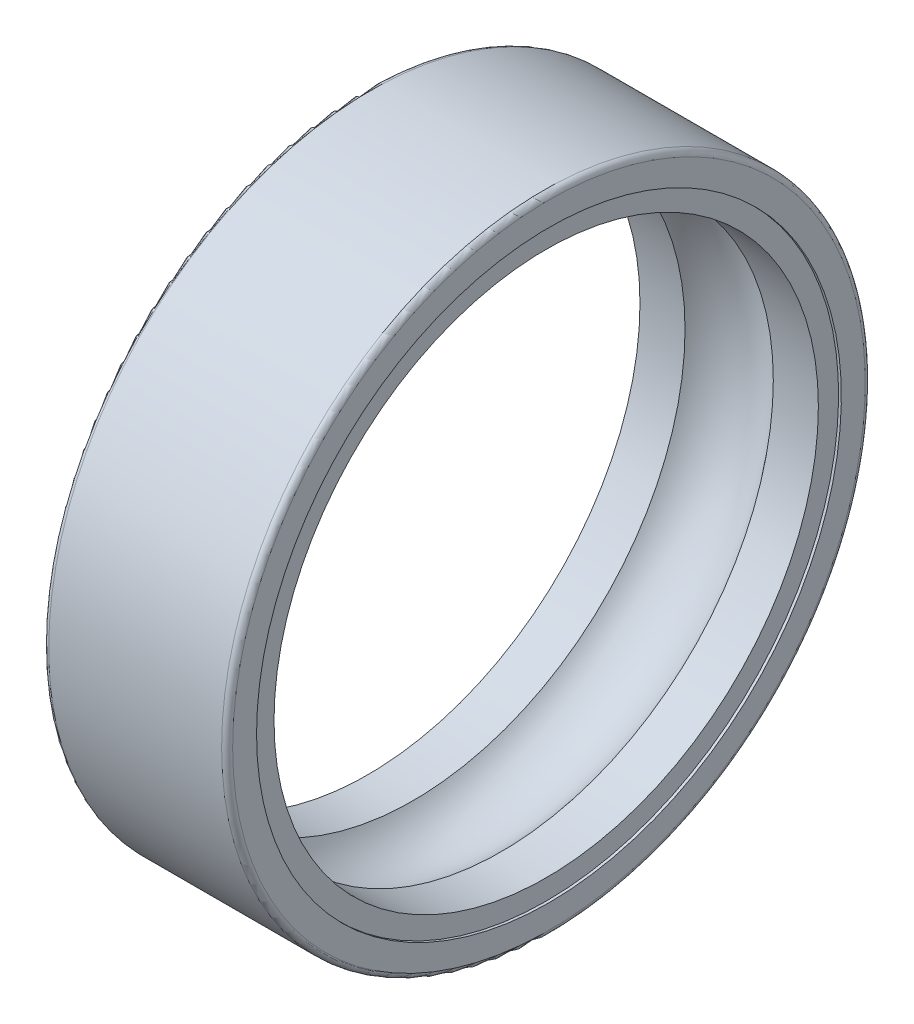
ISO-10303-21;
HEADER;
FILE_DESCRIPTION(('STEP AP214'),'2;1');
FILE_NAME('part.step','',(''),(''),'','','');
FILE_SCHEMA(('AUTOMOTIVE_DESIGN { 1 0 10303 214 1 1 1 1 }'));
ENDSEC;
DATA;
#1=APPLICATION_CONTEXT('core data for automotive mechanical design processes');
#2=APPLICATION_PROTOCOL_DEFINITION('international standard','automotive_design',2000,#1);
#3=PRODUCT_CONTEXT('',#1,'mechanical');
#4=PRODUCT('Part','Part','',(#3));
#5=PRODUCT_RELATED_PRODUCT_CATEGORY('part','',(#4));
#6=PRODUCT_DEFINITION_FORMATION('','',#4);
#7=PRODUCT_DEFINITION_CONTEXT('part definition',#1,'design');
#8=PRODUCT_DEFINITION('design','',#6,#7);
#9=PRODUCT_DEFINITION_SHAPE('','',#8);
#10=(LENGTH_UNIT() NAMED_UNIT(*) SI_UNIT(.MILLI.,.METRE.));
#11=(NAMED_UNIT(*) PLANE_ANGLE_UNIT() SI_UNIT($,.RADIAN.));
#12=(NAMED_UNIT(*) SI_UNIT($,.STERADIAN.) SOLID_ANGLE_UNIT());
#13=UNCERTAINTY_MEASURE_WITH_UNIT(LENGTH_MEASURE(1.E-05),#10,'distance_accuracy_value','');
#14=(GEOMETRIC_REPRESENTATION_CONTEXT(3) GLOBAL_UNCERTAINTY_ASSIGNED_CONTEXT((#13)) GLOBAL_UNIT_ASSIGNED_CONTEXT((#10,
#11,#12)) REPRESENTATION_CONTEXT('',''));
#15=CARTESIAN_POINT('',(0.,0.,0.));
#16=DIRECTION('',(0.,0.,1.));
#17=DIRECTION('',(1.,0.,0.));
#18=AXIS2_PLACEMENT_3D('',#15,#16,#17);
#19=CARTESIAN_POINT('',(0.,0.,0.));
#20=DIRECTION('',(-1.,0.,0.));
#21=DIRECTION('',(0.,0.,1.));
#22=AXIS2_PLACEMENT_3D('',#19,#20,#21);
#23=CYLINDRICAL_SURFACE('',#22,14.8);
#24=CARTESIAN_POINT('',(4.85,0.,0.));
#25=DIRECTION('',(-1.,0.,0.));
#26=DIRECTION('',(0.,0.,1.));
#27=AXIS2_PLACEMENT_3D('',#24,#25,#26);
#28=CIRCLE('',#27,14.8);
#29=CARTESIAN_POINT('',(4.85,0.,14.8));
#30=VERTEX_POINT('',#29);
#31=EDGE_CURVE('E42',#30,#30,#28,.F.);
#32=ORIENTED_EDGE('',*,*,#31,.T.);
#33=EDGE_LOOP('',(#32));
#34=FACE_BOUND('',#33,.T.);
#35=CARTESIAN_POINT('',(2.4,0.,0.));
#36=DIRECTION('',(-1.,0.,0.));
#37=DIRECTION('',(0.,0.,1.));
#38=AXIS2_PLACEMENT_3D('',#35,#36,#37);
#39=CIRCLE('',#38,14.8);
#40=CARTESIAN_POINT('',(2.4,0.,14.8));
#41=VERTEX_POINT('',#40);
#42=EDGE_CURVE('E41',#41,#41,#39,.T.);
#43=ORIENTED_EDGE('',*,*,#42,.T.);
#44=EDGE_LOOP('',(#43));
#45=FACE_BOUND('',#44,.T.);
#46=ADVANCED_FACE('F14',(#34,#45),#23,.F.);
#47=CARTESIAN_POINT('',(0.,0.,0.));
#48=DIRECTION('',(-1.,0.,0.));
#49=DIRECTION('',(0.,0.,1.));
#50=AXIS2_PLACEMENT_3D('',#47,#48,#49);
#51=CYLINDRICAL_SURFACE('',#50,17.5);
#52=CARTESIAN_POINT('',(4.7,0.,0.));
#53=DIRECTION('',(-1.,0.,0.));
#54=DIRECTION('',(0.,0.,1.));
#55=AXIS2_PLACEMENT_3D('',#52,#53,#54);
#56=CIRCLE('',#55,17.5);
#57=CARTESIAN_POINT('',(4.7,0.,17.5));
#58=VERTEX_POINT('',#57);
#59=EDGE_CURVE('E46',#58,#58,#56,.T.);
#60=ORIENTED_EDGE('',*,*,#59,.T.);
#61=EDGE_LOOP('',(#60));
#62=FACE_BOUND('',#61,.T.);
#63=CARTESIAN_POINT('',(-4.7,0.,0.));
#64=DIRECTION('',(-1.,0.,0.));
#65=DIRECTION('',(0.,0.,1.));
#66=AXIS2_PLACEMENT_3D('',#63,#64,#65);
#67=CIRCLE('',#66,17.5);
#68=CARTESIAN_POINT('',(-4.7,0.,17.5));
#69=VERTEX_POINT('',#68);
#70=EDGE_CURVE('E10',#69,#69,#67,.T.);
#71=ORIENTED_EDGE('',*,*,#70,.F.);
#72=EDGE_LOOP('',(#71));
#73=FACE_BOUND('',#72,.T.);
#74=ADVANCED_FACE('F16',(#62,#73),#51,.T.);
#75=CARTESIAN_POINT('',(-4.7,0.,0.));
#76=DIRECTION('',(-1.,0.,0.));
#77=DIRECTION('',(0.,0.,1.));
#78=AXIS2_PLACEMENT_3D('',#75,#76,#77);
#79=TOROIDAL_SURFACE('',#78,17.2,0.3);
#80=CARTESIAN_POINT('',(-5.,0.,0.));
#81=DIRECTION('',(-1.,0.,0.));
#82=DIRECTION('',(0.,0.,1.));
#83=AXIS2_PLACEMENT_3D('',#80,#81,#82);
#84=CIRCLE('',#83,17.2);
#85=CARTESIAN_POINT('',(-5.,0.,17.2));
#86=VERTEX_POINT('',#85);
#87=EDGE_CURVE('E23',#86,#86,#84,.T.);
#88=ORIENTED_EDGE('',*,*,#87,.F.);
#89=EDGE_LOOP('',(#88));
#90=FACE_BOUND('',#89,.T.);
#91=ORIENTED_EDGE('',*,*,#70,.T.);
#92=EDGE_LOOP('',(#91));
#93=FACE_BOUND('',#92,.T.);
#94=ADVANCED_FACE('F105',(#90,#93),#79,.T.);
#95=CARTESIAN_POINT('',(-5.,14.8,0.));
#96=DIRECTION('',(-1.,0.,0.));
#97=DIRECTION('',(0.,0.,1.));
#98=AXIS2_PLACEMENT_3D('',#95,#96,#97);
#99=PLANE('',#98);
#100=CARTESIAN_POINT('',(-5.,0.,0.));
#101=DIRECTION('',(-1.,0.,0.));
#102=DIRECTION('',(0.,0.,1.));
#103=AXIS2_PLACEMENT_3D('',#100,#101,#102);
#104=CIRCLE('',#103,15.9);
#105=CARTESIAN_POINT('',(-5.,0.,15.9));
#106=VERTEX_POINT('',#105);
#107=EDGE_CURVE('E18',#106,#106,#104,.T.);
#108=ORIENTED_EDGE('',*,*,#107,.F.);
#109=EDGE_LOOP('',(#108));
#110=FACE_BOUND('',#109,.T.);
#111=ORIENTED_EDGE('',*,*,#87,.T.);
#112=EDGE_LOOP('',(#111));
#113=FACE_BOUND('',#112,.T.);
#114=ADVANCED_FACE('F98',(#110,#113),#99,.T.);
#115=CARTESIAN_POINT('',(-4.85,0.,0.));
#116=DIRECTION('',(1.,0.,0.));
#117=DIRECTION('',(0.,0.,-1.));
#118=AXIS2_PLACEMENT_3D('',#115,#116,#117);
#119=CIRCLE('',#118,14.8);
#120=CARTESIAN_POINT('',(-4.85,0.,-14.8));
#121=VERTEX_POINT('',#120);
#122=EDGE_CURVE('E54',#121,#121,#119,.F.);
#123=ORIENTED_EDGE('',*,*,#122,.T.);
#124=EDGE_LOOP('',(#123));
#125=FACE_BOUND('',#124,.T.);
#126=CARTESIAN_POINT('',(-2.4,0.,0.));
#127=DIRECTION('',(1.,0.,0.));
#128=DIRECTION('',(0.,0.,-1.));
#129=AXIS2_PLACEMENT_3D('',#126,#127,#128);
#130=CIRCLE('',#129,14.8);
#131=CARTESIAN_POINT('',(-2.4,0.,-14.8));
#132=VERTEX_POINT('',#131);
#133=EDGE_CURVE('E37',#132,#132,#130,.T.);
#134=ORIENTED_EDGE('',*,*,#133,.T.);
#135=EDGE_LOOP('',(#134));
#136=FACE_BOUND('',#135,.T.);
#137=ADVANCED_FACE('F87',(#125,#136),#23,.F.);
#138=CARTESIAN_POINT('',(5.,14.8,0.));
#139=DIRECTION('',(-1.,0.,0.));
#140=DIRECTION('',(0.,0.,1.));
#141=AXIS2_PLACEMENT_3D('',#138,#139,#140);
#142=PLANE('',#141);
#143=CARTESIAN_POINT('',(5.,0.,0.));
#144=DIRECTION('',(-1.,0.,0.));
#145=DIRECTION('',(0.,0.,1.));
#146=AXIS2_PLACEMENT_3D('',#143,#144,#145);
#147=CIRCLE('',#146,15.9);
#148=CARTESIAN_POINT('',(5.,0.,15.9));
#149=VERTEX_POINT('',#148);
#150=EDGE_CURVE('E47',#149,#149,#147,.T.);
#151=ORIENTED_EDGE('',*,*,#150,.T.);
#152=EDGE_LOOP('',(#151));
#153=FACE_BOUND('',#152,.T.);
#154=CARTESIAN_POINT('',(5.,0.,0.));
#155=DIRECTION('',(-1.,0.,0.));
#156=DIRECTION('',(0.,0.,1.));
#157=AXIS2_PLACEMENT_3D('',#154,#155,#156);
#158=CIRCLE('',#157,17.2);
#159=CARTESIAN_POINT('',(5.,0.,17.2));
#160=VERTEX_POINT('',#159);
#161=EDGE_CURVE('E33',#160,#160,#158,.T.);
#162=ORIENTED_EDGE('',*,*,#161,.F.);
#163=EDGE_LOOP('',(#162));
#164=FACE_BOUND('',#163,.T.);
#165=ADVANCED_FACE('F85',(#153,#164),#142,.F.);
#166=CARTESIAN_POINT('',(4.7,0.,0.));
#167=DIRECTION('',(-1.,0.,0.));
#168=DIRECTION('',(0.,0.,1.));
#169=AXIS2_PLACEMENT_3D('',#166,#167,#168);
#170=TOROIDAL_SURFACE('',#169,17.2,0.3);
#171=ORIENTED_EDGE('',*,*,#59,.F.);
#172=EDGE_LOOP('',(#171));
#173=FACE_BOUND('',#172,.T.);
#174=ORIENTED_EDGE('',*,*,#161,.T.);
#175=EDGE_LOOP('',(#174));
#176=FACE_BOUND('',#175,.T.);
#177=ADVANCED_FACE('F83',(#173,#176),#170,.T.);
#178=CARTESIAN_POINT('',(0.,0.,0.));
#179=DIRECTION('',(1.,0.,0.));
#180=DIRECTION('',(0.,-1.,0.));
#181=AXIS2_PLACEMENT_3D('',#178,#179,#180);
#182=TOROIDAL_SURFACE('',#181,13.,3.);
#183=ORIENTED_EDGE('',*,*,#133,.F.);
#184=EDGE_LOOP('',(#183));
#185=FACE_BOUND('',#184,.T.);
#186=ORIENTED_EDGE('',*,*,#42,.F.);
#187=EDGE_LOOP('',(#186));
#188=FACE_BOUND('',#187,.T.);
#189=ADVANCED_FACE('F95',(#185,#188),#182,.F.);
#190=CARTESIAN_POINT('',(4.85,0.,0.));
#191=DIRECTION('',(-1.,0.,0.));
#192=DIRECTION('',(0.,0.,1.));
#193=AXIS2_PLACEMENT_3D('',#190,#191,#192);
#194=PLANE('',#193);
#195=CARTESIAN_POINT('',(4.85,0.,0.));
#196=DIRECTION('',(1.,0.,0.));
#197=DIRECTION('',(0.,-1.,0.));
#198=AXIS2_PLACEMENT_3D('',#195,#196,#197);
#199=CIRCLE('',#198,15.9);
#200=CARTESIAN_POINT('',(4.85,-15.9,0.));
#201=VERTEX_POINT('',#200);
#202=EDGE_CURVE('E51',#201,#201,#199,.T.);
#203=ORIENTED_EDGE('',*,*,#202,.T.);
#204=EDGE_LOOP('',(#203));
#205=FACE_BOUND('',#204,.T.);
#206=ORIENTED_EDGE('',*,*,#31,.F.);
#207=EDGE_LOOP('',(#206));
#208=FACE_BOUND('',#207,.T.);
#209=ADVANCED_FACE('F151',(#205,#208),#194,.F.);
#210=CARTESIAN_POINT('',(4.85,0.,0.));
#211=DIRECTION('',(1.,0.,0.));
#212=DIRECTION('',(0.,-1.,0.));
#213=AXIS2_PLACEMENT_3D('',#210,#211,#212);
#214=CYLINDRICAL_SURFACE('',#213,15.9);
#215=ORIENTED_EDGE('',*,*,#202,.F.);
#216=EDGE_LOOP('',(#215));
#217=FACE_BOUND('',#216,.T.);
#218=ORIENTED_EDGE('',*,*,#150,.F.);
#219=EDGE_LOOP('',(#218));
#220=FACE_BOUND('',#219,.T.);
#221=ADVANCED_FACE('F161',(#217,#220),#214,.F.);
#222=CARTESIAN_POINT('',(-4.85,0.,0.));
#223=DIRECTION('',(1.,0.,0.));
#224=DIRECTION('',(0.,0.,-1.));
#225=AXIS2_PLACEMENT_3D('',#222,#223,#224);
#226=PLANE('',#225);
#227=CARTESIAN_POINT('',(-4.85,0.,0.));
#228=DIRECTION('',(-1.,0.,0.));
#229=DIRECTION('',(0.,-1.,0.));
#230=AXIS2_PLACEMENT_3D('',#227,#228,#229);
#231=CIRCLE('',#230,15.9);
#232=CARTESIAN_POINT('',(-4.85,-15.9,0.));
#233=VERTEX_POINT('',#232);
#234=EDGE_CURVE('E57',#233,#233,#231,.T.);
#235=ORIENTED_EDGE('',*,*,#234,.T.);
#236=EDGE_LOOP('',(#235));
#237=FACE_BOUND('',#236,.T.);
#238=ORIENTED_EDGE('',*,*,#122,.F.);
#239=EDGE_LOOP('',(#238));
#240=FACE_BOUND('',#239,.T.);
#241=ADVANCED_FACE('F171',(#237,#240),#226,.F.);
#242=CARTESIAN_POINT('',(-4.85,0.,0.));
#243=DIRECTION('',(-1.,0.,0.));
#244=DIRECTION('',(0.,-1.,0.));
#245=AXIS2_PLACEMENT_3D('',#242,#243,#244);
#246=CYLINDRICAL_SURFACE('',#245,15.9);
#247=ORIENTED_EDGE('',*,*,#107,.T.);
#248=EDGE_LOOP('',(#247));
#249=FACE_BOUND('',#248,.T.);
#250=ORIENTED_EDGE('',*,*,#234,.F.);
#251=EDGE_LOOP('',(#250));
#252=FACE_BOUND('',#251,.T.);
#253=ADVANCED_FACE('F180',(#249,#252),#246,.F.);
#254=CLOSED_SHELL('',(#46,#74,#94,#114,#137,#165,#177,#189,#209,#221,#241,#253));
#255=MANIFOLD_SOLID_BREP('B1',#254);
#256=ADVANCED_BREP_SHAPE_REPRESENTATION('',(#18,#255),#14);
#257=SHAPE_DEFINITION_REPRESENTATION(#9,#256);
ENDSEC;
END-ISO-10303-21;
